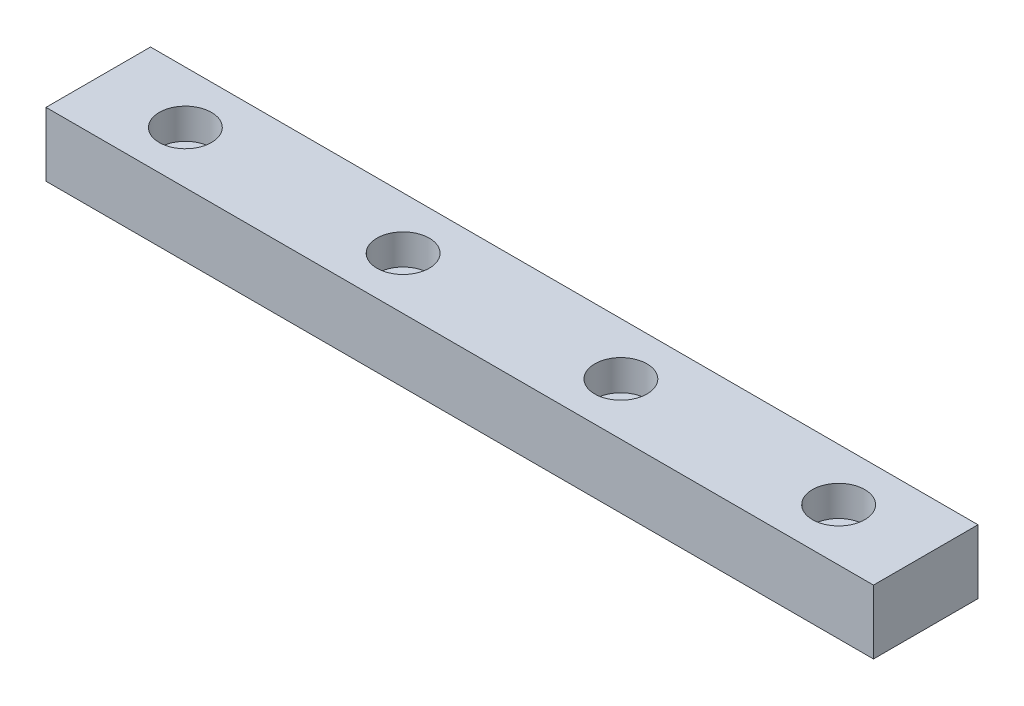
ISO-10303-21;
HEADER;
FILE_DESCRIPTION(('STEP AP214'),'2;1');
FILE_NAME('part.step','',(''),(''),'','','');
FILE_SCHEMA(('AUTOMOTIVE_DESIGN { 1 0 10303 214 1 1 1 1 }'));
ENDSEC;
DATA;
#1=APPLICATION_CONTEXT('core data for automotive mechanical design processes');
#2=APPLICATION_PROTOCOL_DEFINITION('international standard','automotive_design',2000,#1);
#3=PRODUCT_CONTEXT('',#1,'mechanical');
#4=PRODUCT('Part','Part','',(#3));
#5=PRODUCT_RELATED_PRODUCT_CATEGORY('part','',(#4));
#6=PRODUCT_DEFINITION_FORMATION('','',#4);
#7=PRODUCT_DEFINITION_CONTEXT('part definition',#1,'design');
#8=PRODUCT_DEFINITION('design','',#6,#7);
#9=PRODUCT_DEFINITION_SHAPE('','',#8);
#10=(LENGTH_UNIT() NAMED_UNIT(*) SI_UNIT(.MILLI.,.METRE.));
#11=(NAMED_UNIT(*) PLANE_ANGLE_UNIT() SI_UNIT($,.RADIAN.));
#12=(NAMED_UNIT(*) SI_UNIT($,.STERADIAN.) SOLID_ANGLE_UNIT());
#13=UNCERTAINTY_MEASURE_WITH_UNIT(LENGTH_MEASURE(1.E-05),#10,'distance_accuracy_value','');
#14=(GEOMETRIC_REPRESENTATION_CONTEXT(3) GLOBAL_UNCERTAINTY_ASSIGNED_CONTEXT((#13)) GLOBAL_UNIT_ASSIGNED_CONTEXT((#10,
#11,#12)) REPRESENTATION_CONTEXT('',''));
#15=CARTESIAN_POINT('',(0.,0.,0.));
#16=DIRECTION('',(0.,0.,1.));
#17=DIRECTION('',(1.,0.,0.));
#18=AXIS2_PLACEMENT_3D('',#15,#16,#17);
#19=CARTESIAN_POINT('',(85.,-4.65000000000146,6.));
#20=DIRECTION('',(0.,1.,0.));
#21=DIRECTION('',(0.,0.,1.));
#22=AXIS2_PLACEMENT_3D('',#19,#20,#21);
#23=CYLINDRICAL_SURFACE('',#22,1.75);
#24=CARTESIAN_POINT('',(85.,0.,6.));
#25=DIRECTION('',(0.,1.,0.));
#26=DIRECTION('',(0.,0.,1.));
#27=AXIS2_PLACEMENT_3D('',#24,#25,#26);
#28=CIRCLE('',#27,1.75);
#29=CARTESIAN_POINT('',(85.,0.,7.75));
#30=VERTEX_POINT('',#29);
#31=EDGE_CURVE('E111',#30,#30,#28,.T.);
#32=ORIENTED_EDGE('',*,*,#31,.F.);
#33=EDGE_LOOP('',(#32));
#34=FACE_BOUND('',#33,.T.);
#35=CARTESIAN_POINT('',(85.,3.84999999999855,6.));
#36=DIRECTION('',(0.,1.,0.));
#37=DIRECTION('',(0.,0.,1.));
#38=AXIS2_PLACEMENT_3D('',#35,#36,#37);
#39=CIRCLE('',#38,1.75);
#40=CARTESIAN_POINT('',(85.,3.84999999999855,7.75));
#41=VERTEX_POINT('',#40);
#42=EDGE_CURVE('E36',#41,#41,#39,.F.);
#43=ORIENTED_EDGE('',*,*,#42,.F.);
#44=EDGE_LOOP('',(#43));
#45=FACE_BOUND('',#44,.T.);
#46=ADVANCED_FACE('F32',(#34,#45),#23,.F.);
#47=CARTESIAN_POINT('',(10.,-4.65000000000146,6.));
#48=DIRECTION('',(0.,1.,0.));
#49=DIRECTION('',(0.,0.,1.));
#50=AXIS2_PLACEMENT_3D('',#47,#48,#49);
#51=CYLINDRICAL_SURFACE('',#50,1.75);
#52=CARTESIAN_POINT('',(10.,0.,6.));
#53=DIRECTION('',(0.,1.,0.));
#54=DIRECTION('',(0.,0.,1.));
#55=AXIS2_PLACEMENT_3D('',#52,#53,#54);
#56=CIRCLE('',#55,1.75);
#57=CARTESIAN_POINT('',(10.,0.,7.75));
#58=VERTEX_POINT('',#57);
#59=EDGE_CURVE('E144',#58,#58,#56,.T.);
#60=ORIENTED_EDGE('',*,*,#59,.F.);
#61=EDGE_LOOP('',(#60));
#62=FACE_BOUND('',#61,.T.);
#63=CARTESIAN_POINT('',(10.,3.84999999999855,6.));
#64=DIRECTION('',(0.,1.,0.));
#65=DIRECTION('',(0.,0.,1.));
#66=AXIS2_PLACEMENT_3D('',#63,#64,#65);
#67=CIRCLE('',#66,1.75);
#68=CARTESIAN_POINT('',(10.,3.84999999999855,7.75));
#69=VERTEX_POINT('',#68);
#70=EDGE_CURVE('E117',#69,#69,#67,.F.);
#71=ORIENTED_EDGE('',*,*,#70,.F.);
#72=EDGE_LOOP('',(#71));
#73=FACE_BOUND('',#72,.T.);
#74=ADVANCED_FACE('F179',(#62,#73),#51,.F.);
#75=CARTESIAN_POINT('',(35.,-4.65000000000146,6.));
#76=DIRECTION('',(0.,1.,0.));
#77=DIRECTION('',(0.,0.,1.));
#78=AXIS2_PLACEMENT_3D('',#75,#76,#77);
#79=CYLINDRICAL_SURFACE('',#78,1.75);
#80=CARTESIAN_POINT('',(35.,0.,6.));
#81=DIRECTION('',(0.,1.,0.));
#82=DIRECTION('',(0.,0.,1.));
#83=AXIS2_PLACEMENT_3D('',#80,#81,#82);
#84=CIRCLE('',#83,1.75);
#85=CARTESIAN_POINT('',(35.,0.,7.75));
#86=VERTEX_POINT('',#85);
#87=EDGE_CURVE('E147',#86,#86,#84,.T.);
#88=ORIENTED_EDGE('',*,*,#87,.F.);
#89=EDGE_LOOP('',(#88));
#90=FACE_BOUND('',#89,.T.);
#91=CARTESIAN_POINT('',(35.,3.84999999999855,6.));
#92=DIRECTION('',(0.,1.,0.));
#93=DIRECTION('',(0.,0.,1.));
#94=AXIS2_PLACEMENT_3D('',#91,#92,#93);
#95=CIRCLE('',#94,1.75);
#96=CARTESIAN_POINT('',(35.,3.84999999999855,7.75));
#97=VERTEX_POINT('',#96);
#98=EDGE_CURVE('E113',#97,#97,#95,.F.);
#99=ORIENTED_EDGE('',*,*,#98,.F.);
#100=EDGE_LOOP('',(#99));
#101=FACE_BOUND('',#100,.T.);
#102=ADVANCED_FACE('F158',(#90,#101),#79,.F.);
#103=CARTESIAN_POINT('',(60.,-4.65000000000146,6.));
#104=DIRECTION('',(0.,1.,0.));
#105=DIRECTION('',(0.,0.,1.));
#106=AXIS2_PLACEMENT_3D('',#103,#104,#105);
#107=CYLINDRICAL_SURFACE('',#106,1.75);
#108=CARTESIAN_POINT('',(60.,0.,6.));
#109=DIRECTION('',(0.,1.,0.));
#110=DIRECTION('',(0.,0.,1.));
#111=AXIS2_PLACEMENT_3D('',#108,#109,#110);
#112=CIRCLE('',#111,1.75);
#113=CARTESIAN_POINT('',(60.,0.,7.75));
#114=VERTEX_POINT('',#113);
#115=EDGE_CURVE('E102',#114,#114,#112,.T.);
#116=ORIENTED_EDGE('',*,*,#115,.F.);
#117=EDGE_LOOP('',(#116));
#118=FACE_BOUND('',#117,.T.);
#119=CARTESIAN_POINT('',(60.,3.84999999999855,6.));
#120=DIRECTION('',(0.,1.,0.));
#121=DIRECTION('',(0.,0.,1.));
#122=AXIS2_PLACEMENT_3D('',#119,#120,#121);
#123=CIRCLE('',#122,1.75);
#124=CARTESIAN_POINT('',(60.,3.84999999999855,7.75));
#125=VERTEX_POINT('',#124);
#126=EDGE_CURVE('E108',#125,#125,#123,.F.);
#127=ORIENTED_EDGE('',*,*,#126,.F.);
#128=EDGE_LOOP('',(#127));
#129=FACE_BOUND('',#128,.T.);
#130=ADVANCED_FACE('F155',(#118,#129),#107,.F.);
#131=CARTESIAN_POINT('',(0.,0.,12.));
#132=DIRECTION('',(0.,1.,0.));
#133=DIRECTION('',(0.,0.,1.));
#134=AXIS2_PLACEMENT_3D('',#131,#132,#133);
#135=PLANE('',#134);
#136=ORIENTED_EDGE('',*,*,#31,.T.);
#137=EDGE_LOOP('',(#136));
#138=FACE_BOUND('',#137,.T.);
#139=ORIENTED_EDGE('',*,*,#59,.T.);
#140=EDGE_LOOP('',(#139));
#141=FACE_BOUND('',#140,.T.);
#142=ORIENTED_EDGE('',*,*,#87,.T.);
#143=EDGE_LOOP('',(#142));
#144=FACE_BOUND('',#143,.T.);
#145=ORIENTED_EDGE('',*,*,#115,.T.);
#146=EDGE_LOOP('',(#145));
#147=FACE_BOUND('',#146,.T.);
#148=DIRECTION('',(1.,0.,0.));
#149=VECTOR('',#148,1.);
#150=CARTESIAN_POINT('',(0.,0.,0.));
#151=LINE('',#150,#149);
#152=CARTESIAN_POINT('',(0.,0.,0.));
#153=VERTEX_POINT('',#152);
#154=CARTESIAN_POINT('',(95.,0.,0.));
#155=VERTEX_POINT('',#154);
#156=EDGE_CURVE('E99',#153,#155,#151,.T.);
#157=ORIENTED_EDGE('',*,*,#156,.T.);
#158=DIRECTION('',(0.,0.,-1.));
#159=VECTOR('',#158,1.);
#160=CARTESIAN_POINT('',(95.,0.,12.));
#161=LINE('',#160,#159);
#162=CARTESIAN_POINT('',(95.,0.,12.));
#163=VERTEX_POINT('',#162);
#164=EDGE_CURVE('E11',#163,#155,#161,.T.);
#165=ORIENTED_EDGE('',*,*,#164,.F.);
#166=DIRECTION('',(1.,0.,0.));
#167=VECTOR('',#166,1.);
#168=CARTESIAN_POINT('',(0.,0.,12.));
#169=LINE('',#168,#167);
#170=CARTESIAN_POINT('',(0.,0.,12.));
#171=VERTEX_POINT('',#170);
#172=EDGE_CURVE('E86',#171,#163,#169,.T.);
#173=ORIENTED_EDGE('',*,*,#172,.F.);
#174=DIRECTION('',(0.,0.,-1.));
#175=VECTOR('',#174,1.);
#176=CARTESIAN_POINT('',(0.,0.,12.));
#177=LINE('',#176,#175);
#178=EDGE_CURVE('E95',#171,#153,#177,.T.);
#179=ORIENTED_EDGE('',*,*,#178,.T.);
#180=EDGE_LOOP('',(#157,#165,#173,#179));
#181=FACE_BOUND('',#180,.T.);
#182=ADVANCED_FACE('F34',(#138,#141,#144,#147,#181),#135,.F.);
#183=CARTESIAN_POINT('',(95.,0.,12.));
#184=DIRECTION('',(-1.,0.,0.));
#185=DIRECTION('',(0.,0.,1.));
#186=AXIS2_PLACEMENT_3D('',#183,#184,#185);
#187=PLANE('',#186);
#188=DIRECTION('',(0.,1.,0.));
#189=VECTOR('',#188,1.);
#190=CARTESIAN_POINT('',(95.,0.,0.));
#191=LINE('',#190,#189);
#192=CARTESIAN_POINT('',(95.,7.34999999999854,0.));
#193=VERTEX_POINT('',#192);
#194=EDGE_CURVE('E90',#155,#193,#191,.T.);
#195=ORIENTED_EDGE('',*,*,#194,.T.);
#196=DIRECTION('',(0.,0.,-1.));
#197=VECTOR('',#196,1.);
#198=CARTESIAN_POINT('',(95.,7.34999999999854,12.));
#199=LINE('',#198,#197);
#200=CARTESIAN_POINT('',(95.,7.34999999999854,12.));
#201=VERTEX_POINT('',#200);
#202=EDGE_CURVE('E42',#201,#193,#199,.T.);
#203=ORIENTED_EDGE('',*,*,#202,.F.);
#204=DIRECTION('',(0.,1.,0.));
#205=VECTOR('',#204,1.);
#206=CARTESIAN_POINT('',(95.,0.,12.));
#207=LINE('',#206,#205);
#208=EDGE_CURVE('E81',#163,#201,#207,.T.);
#209=ORIENTED_EDGE('',*,*,#208,.F.);
#210=ORIENTED_EDGE('',*,*,#164,.T.);
#211=EDGE_LOOP('',(#195,#203,#209,#210));
#212=FACE_BOUND('',#211,.T.);
#213=ADVANCED_FACE('F89',(#212),#187,.F.);
#214=CARTESIAN_POINT('',(0.,7.34999999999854,12.));
#215=DIRECTION('',(0.,-1.,0.));
#216=DIRECTION('',(0.,0.,-1.));
#217=AXIS2_PLACEMENT_3D('',#214,#215,#216);
#218=PLANE('',#217);
#219=CARTESIAN_POINT('',(85.,7.34999999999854,6.));
#220=DIRECTION('',(0.,1.,0.));
#221=DIRECTION('',(0.,0.,1.));
#222=AXIS2_PLACEMENT_3D('',#219,#220,#221);
#223=CIRCLE('',#222,3.);
#224=CARTESIAN_POINT('',(85.,7.34999999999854,9.));
#225=VERTEX_POINT('',#224);
#226=EDGE_CURVE('E133',#225,#225,#223,.T.);
#227=ORIENTED_EDGE('',*,*,#226,.F.);
#228=EDGE_LOOP('',(#227));
#229=FACE_BOUND('',#228,.T.);
#230=CARTESIAN_POINT('',(10.,7.34999999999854,6.));
#231=DIRECTION('',(0.,1.,0.));
#232=DIRECTION('',(0.,0.,1.));
#233=AXIS2_PLACEMENT_3D('',#230,#231,#232);
#234=CIRCLE('',#233,3.);
#235=CARTESIAN_POINT('',(10.,7.34999999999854,9.));
#236=VERTEX_POINT('',#235);
#237=EDGE_CURVE('E126',#236,#236,#234,.T.);
#238=ORIENTED_EDGE('',*,*,#237,.F.);
#239=EDGE_LOOP('',(#238));
#240=FACE_BOUND('',#239,.T.);
#241=CARTESIAN_POINT('',(35.,7.34999999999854,6.));
#242=DIRECTION('',(0.,1.,0.));
#243=DIRECTION('',(0.,0.,1.));
#244=AXIS2_PLACEMENT_3D('',#241,#242,#243);
#245=CIRCLE('',#244,3.);
#246=CARTESIAN_POINT('',(35.,7.34999999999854,9.));
#247=VERTEX_POINT('',#246);
#248=EDGE_CURVE('E119',#247,#247,#245,.T.);
#249=ORIENTED_EDGE('',*,*,#248,.F.);
#250=EDGE_LOOP('',(#249));
#251=FACE_BOUND('',#250,.T.);
#252=CARTESIAN_POINT('',(60.,7.34999999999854,6.));
#253=DIRECTION('',(0.,1.,0.));
#254=DIRECTION('',(0.,0.,1.));
#255=AXIS2_PLACEMENT_3D('',#252,#253,#254);
#256=CIRCLE('',#255,3.);
#257=CARTESIAN_POINT('',(60.,7.34999999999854,9.));
#258=VERTEX_POINT('',#257);
#259=EDGE_CURVE('E115',#258,#258,#256,.T.);
#260=ORIENTED_EDGE('',*,*,#259,.F.);
#261=EDGE_LOOP('',(#260));
#262=FACE_BOUND('',#261,.T.);
#263=DIRECTION('',(-1.,0.,0.));
#264=VECTOR('',#263,1.);
#265=CARTESIAN_POINT('',(0.,7.34999999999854,0.));
#266=LINE('',#265,#264);
#267=CARTESIAN_POINT('',(0.,7.34999999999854,0.));
#268=VERTEX_POINT('',#267);
#269=EDGE_CURVE('E68',#193,#268,#266,.T.);
#270=ORIENTED_EDGE('',*,*,#269,.T.);
#271=DIRECTION('',(0.,0.,-1.));
#272=VECTOR('',#271,1.);
#273=CARTESIAN_POINT('',(0.,7.34999999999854,12.));
#274=LINE('',#273,#272);
#275=CARTESIAN_POINT('',(0.,7.34999999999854,12.));
#276=VERTEX_POINT('',#275);
#277=EDGE_CURVE('E91',#276,#268,#274,.T.);
#278=ORIENTED_EDGE('',*,*,#277,.F.);
#279=DIRECTION('',(-1.,0.,0.));
#280=VECTOR('',#279,1.);
#281=CARTESIAN_POINT('',(0.,7.34999999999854,12.));
#282=LINE('',#281,#280);
#283=EDGE_CURVE('E84',#201,#276,#282,.T.);
#284=ORIENTED_EDGE('',*,*,#283,.F.);
#285=ORIENTED_EDGE('',*,*,#202,.T.);
#286=EDGE_LOOP('',(#270,#278,#284,#285));
#287=FACE_BOUND('',#286,.T.);
#288=ADVANCED_FACE('F93',(#229,#240,#251,#262,#287),#218,.F.);
#289=CARTESIAN_POINT('',(0.,0.,12.));
#290=DIRECTION('',(1.,0.,0.));
#291=DIRECTION('',(0.,0.,-1.));
#292=AXIS2_PLACEMENT_3D('',#289,#290,#291);
#293=PLANE('',#292);
#294=DIRECTION('',(0.,-1.,0.));
#295=VECTOR('',#294,1.);
#296=CARTESIAN_POINT('',(0.,0.,0.));
#297=LINE('',#296,#295);
#298=EDGE_CURVE('E74',#268,#153,#297,.T.);
#299=ORIENTED_EDGE('',*,*,#298,.T.);
#300=ORIENTED_EDGE('',*,*,#178,.F.);
#301=DIRECTION('',(0.,-1.,0.));
#302=VECTOR('',#301,1.);
#303=CARTESIAN_POINT('',(0.,0.,12.));
#304=LINE('',#303,#302);
#305=EDGE_CURVE('E51',#276,#171,#304,.T.);
#306=ORIENTED_EDGE('',*,*,#305,.F.);
#307=ORIENTED_EDGE('',*,*,#277,.T.);
#308=EDGE_LOOP('',(#299,#300,#306,#307));
#309=FACE_BOUND('',#308,.T.);
#310=ADVANCED_FACE('F194',(#309),#293,.F.);
#311=CARTESIAN_POINT('',(95.,0.,12.));
#312=DIRECTION('',(0.,0.,1.));
#313=DIRECTION('',(1.,0.,0.));
#314=AXIS2_PLACEMENT_3D('',#311,#312,#313);
#315=PLANE('',#314);
#316=ORIENTED_EDGE('',*,*,#172,.T.);
#317=ORIENTED_EDGE('',*,*,#208,.T.);
#318=ORIENTED_EDGE('',*,*,#283,.T.);
#319=ORIENTED_EDGE('',*,*,#305,.T.);
#320=EDGE_LOOP('',(#316,#317,#318,#319));
#321=FACE_BOUND('',#320,.T.);
#322=ADVANCED_FACE('F82',(#321),#315,.T.);
#323=CARTESIAN_POINT('',(95.,0.,0.));
#324=DIRECTION('',(0.,0.,1.));
#325=DIRECTION('',(1.,0.,0.));
#326=AXIS2_PLACEMENT_3D('',#323,#324,#325);
#327=PLANE('',#326);
#328=ORIENTED_EDGE('',*,*,#156,.F.);
#329=ORIENTED_EDGE('',*,*,#298,.F.);
#330=ORIENTED_EDGE('',*,*,#269,.F.);
#331=ORIENTED_EDGE('',*,*,#194,.F.);
#332=EDGE_LOOP('',(#328,#329,#330,#331));
#333=FACE_BOUND('',#332,.T.);
#334=ADVANCED_FACE('F165',(#333),#327,.F.);
#335=CARTESIAN_POINT('',(60.,3.84999999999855,6.));
#336=DIRECTION('',(0.,1.,0.));
#337=DIRECTION('',(0.,0.,1.));
#338=AXIS2_PLACEMENT_3D('',#335,#336,#337);
#339=PLANE('',#338);
#340=CARTESIAN_POINT('',(60.,3.84999999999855,6.));
#341=DIRECTION('',(0.,1.,0.));
#342=DIRECTION('',(0.,0.,1.));
#343=AXIS2_PLACEMENT_3D('',#340,#341,#342);
#344=CIRCLE('',#343,3.);
#345=CARTESIAN_POINT('',(60.,3.84999999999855,9.));
#346=VERTEX_POINT('',#345);
#347=EDGE_CURVE('E112',#346,#346,#344,.T.);
#348=ORIENTED_EDGE('',*,*,#347,.T.);
#349=EDGE_LOOP('',(#348));
#350=FACE_BOUND('',#349,.T.);
#351=ORIENTED_EDGE('',*,*,#126,.T.);
#352=EDGE_LOOP('',(#351));
#353=FACE_BOUND('',#352,.T.);
#354=ADVANCED_FACE('F162',(#350,#353),#339,.T.);
#355=CARTESIAN_POINT('',(60.,3.84999999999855,6.));
#356=DIRECTION('',(0.,1.,0.));
#357=DIRECTION('',(0.,0.,1.));
#358=AXIS2_PLACEMENT_3D('',#355,#356,#357);
#359=CYLINDRICAL_SURFACE('',#358,3.);
#360=ORIENTED_EDGE('',*,*,#347,.F.);
#361=EDGE_LOOP('',(#360));
#362=FACE_BOUND('',#361,.T.);
#363=ORIENTED_EDGE('',*,*,#259,.T.);
#364=EDGE_LOOP('',(#363));
#365=FACE_BOUND('',#364,.T.);
#366=ADVANCED_FACE('F164',(#362,#365),#359,.F.);
#367=CARTESIAN_POINT('',(35.,3.84999999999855,6.));
#368=DIRECTION('',(0.,1.,0.));
#369=DIRECTION('',(0.,0.,1.));
#370=AXIS2_PLACEMENT_3D('',#367,#368,#369);
#371=PLANE('',#370);
#372=CARTESIAN_POINT('',(35.,3.84999999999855,6.));
#373=DIRECTION('',(0.,1.,0.));
#374=DIRECTION('',(0.,0.,1.));
#375=AXIS2_PLACEMENT_3D('',#372,#373,#374);
#376=CIRCLE('',#375,3.);
#377=CARTESIAN_POINT('',(35.,3.84999999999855,9.));
#378=VERTEX_POINT('',#377);
#379=EDGE_CURVE('E116',#378,#378,#376,.T.);
#380=ORIENTED_EDGE('',*,*,#379,.T.);
#381=EDGE_LOOP('',(#380));
#382=FACE_BOUND('',#381,.T.);
#383=ORIENTED_EDGE('',*,*,#98,.T.);
#384=EDGE_LOOP('',(#383));
#385=FACE_BOUND('',#384,.T.);
#386=ADVANCED_FACE('F172',(#382,#385),#371,.T.);
#387=CARTESIAN_POINT('',(35.,3.84999999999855,6.));
#388=DIRECTION('',(0.,1.,0.));
#389=DIRECTION('',(0.,0.,1.));
#390=AXIS2_PLACEMENT_3D('',#387,#388,#389);
#391=CYLINDRICAL_SURFACE('',#390,3.);
#392=ORIENTED_EDGE('',*,*,#379,.F.);
#393=EDGE_LOOP('',(#392));
#394=FACE_BOUND('',#393,.T.);
#395=ORIENTED_EDGE('',*,*,#248,.T.);
#396=EDGE_LOOP('',(#395));
#397=FACE_BOUND('',#396,.T.);
#398=ADVANCED_FACE('F215',(#394,#397),#391,.F.);
#399=CARTESIAN_POINT('',(10.,3.84999999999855,6.));
#400=DIRECTION('',(0.,1.,0.));
#401=DIRECTION('',(0.,0.,1.));
#402=AXIS2_PLACEMENT_3D('',#399,#400,#401);
#403=PLANE('',#402);
#404=CARTESIAN_POINT('',(10.,3.84999999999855,6.));
#405=DIRECTION('',(0.,1.,0.));
#406=DIRECTION('',(0.,0.,1.));
#407=AXIS2_PLACEMENT_3D('',#404,#405,#406);
#408=CIRCLE('',#407,3.);
#409=CARTESIAN_POINT('',(10.,3.84999999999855,9.));
#410=VERTEX_POINT('',#409);
#411=EDGE_CURVE('E120',#410,#410,#408,.T.);
#412=ORIENTED_EDGE('',*,*,#411,.T.);
#413=EDGE_LOOP('',(#412));
#414=FACE_BOUND('',#413,.T.);
#415=ORIENTED_EDGE('',*,*,#70,.T.);
#416=EDGE_LOOP('',(#415));
#417=FACE_BOUND('',#416,.T.);
#418=ADVANCED_FACE('F221',(#414,#417),#403,.T.);
#419=CARTESIAN_POINT('',(10.,3.84999999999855,6.));
#420=DIRECTION('',(0.,1.,0.));
#421=DIRECTION('',(0.,0.,1.));
#422=AXIS2_PLACEMENT_3D('',#419,#420,#421);
#423=CYLINDRICAL_SURFACE('',#422,3.);
#424=ORIENTED_EDGE('',*,*,#411,.F.);
#425=EDGE_LOOP('',(#424));
#426=FACE_BOUND('',#425,.T.);
#427=ORIENTED_EDGE('',*,*,#237,.T.);
#428=EDGE_LOOP('',(#427));
#429=FACE_BOUND('',#428,.T.);
#430=ADVANCED_FACE('F224',(#426,#429),#423,.F.);
#431=CARTESIAN_POINT('',(85.,3.84999999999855,6.));
#432=DIRECTION('',(0.,1.,0.));
#433=DIRECTION('',(0.,0.,1.));
#434=AXIS2_PLACEMENT_3D('',#431,#432,#433);
#435=PLANE('',#434);
#436=CARTESIAN_POINT('',(85.,3.84999999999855,6.));
#437=DIRECTION('',(0.,1.,0.));
#438=DIRECTION('',(0.,0.,1.));
#439=AXIS2_PLACEMENT_3D('',#436,#437,#438);
#440=CIRCLE('',#439,3.);
#441=CARTESIAN_POINT('',(85.,3.84999999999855,9.));
#442=VERTEX_POINT('',#441);
#443=EDGE_CURVE('E242',#442,#442,#440,.T.);
#444=ORIENTED_EDGE('',*,*,#443,.T.);
#445=EDGE_LOOP('',(#444));
#446=FACE_BOUND('',#445,.T.);
#447=ORIENTED_EDGE('',*,*,#42,.T.);
#448=EDGE_LOOP('',(#447));
#449=FACE_BOUND('',#448,.T.);
#450=ADVANCED_FACE('F227',(#446,#449),#435,.T.);
#451=CARTESIAN_POINT('',(85.,3.84999999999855,6.));
#452=DIRECTION('',(0.,1.,0.));
#453=DIRECTION('',(0.,0.,1.));
#454=AXIS2_PLACEMENT_3D('',#451,#452,#453);
#455=CYLINDRICAL_SURFACE('',#454,3.);
#456=ORIENTED_EDGE('',*,*,#443,.F.);
#457=EDGE_LOOP('',(#456));
#458=FACE_BOUND('',#457,.T.);
#459=ORIENTED_EDGE('',*,*,#226,.T.);
#460=EDGE_LOOP('',(#459));
#461=FACE_BOUND('',#460,.T.);
#462=ADVANCED_FACE('F231',(#458,#461),#455,.F.);
#463=CLOSED_SHELL('',(#46,#74,#102,#130,#182,#213,#288,#310,#322,#334,#354,#366,#386,#398,#418,
#430,#450,#462));
#464=MANIFOLD_SOLID_BREP('B2',#463);
#465=ADVANCED_BREP_SHAPE_REPRESENTATION('',(#18,#464),#14);
#466=SHAPE_DEFINITION_REPRESENTATION(#9,#465);
ENDSEC;
END-ISO-10303-21;
